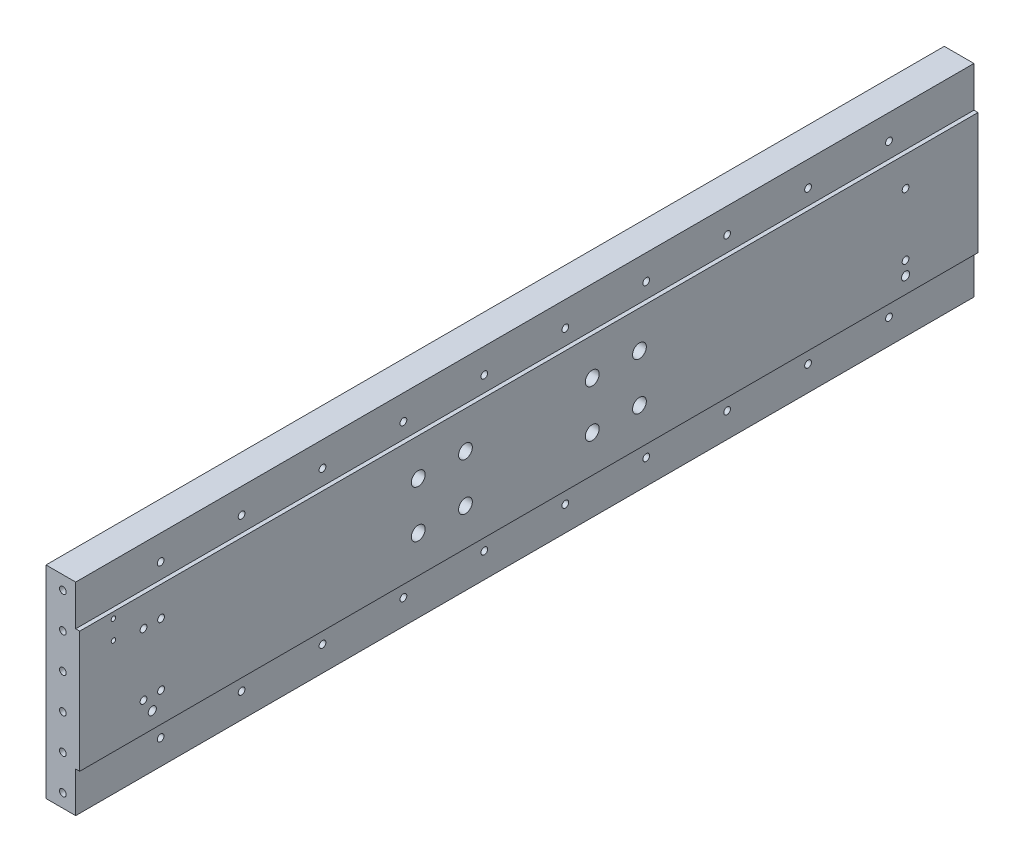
from build123d import *

# Parameters (mm, degrees)
SKIZZE1_W                       = 25
SKIZZE1_H                       = 250
AUFSATZ_LINEAR_AUSTRAGEN1_DEPTH = 700
SKIZZE2_W                       = 22.198987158
SKIZZE2_H                       = 60.887547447
SKIZZE2_W_2                     = 19.880786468
SKIZZE2_H_2                     = 59.665397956
SCHNITT_LINEAR_AUSTRAGEN1_DEPTH = 700
SKIZZE3_W                       = 93.157217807
SKIZZE3_H                       = 100
SCHNITT_LINEAR_AUSTRAGEN2_DEPTH = 700
SKIZZE4_W                       = 3
SKIZZE4_H                       = 30
SCHNITT_LINEAR_AUSTRAGEN3_DEPTH = 700
SKIZZE5_W                       = 80
SKIZZE5_H                       = 241.807077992
SCHNITT_LINEAR_AUSTRAGEN4_DEPTH = 30
AUFSATZ_LINEAR_AUSTRAGEN2_DEPTH = 80
SKIZZE7_W                       = 4
SKIZZE7_H                       = 191.318116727
SCHNITT_LINEAR_AUSTRAGEN5_DEPTH = 100
SKIZZE8_W                       = 30
SKIZZE8_H                       = 183.217358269
SCHNITT_LINEAR_AUSTRAGEN6_DEPTH = 100
M6_GEWINDEBOHRUNG1_D            = 5
M6_GEWINDEBOHRUNG1_DEPTH        = 19
M6_GEWINDEBOHRUNG1_TIP          = 1.502151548
M6_GEWINDEBOHRUNG2_D            = 5
M6_GEWINDEBOHRUNG2_DEPTH        = 20
M6_GEWINDEBOHRUNG2_TIP          = 1.502151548
SKIZZE15_R                      = 3
SCHNITT_LINEAR_AUSTRAGEN7_DEPTH = 15
M6_GEWINDEBOHRUNG3_D            = 5
M6_GEWINDEBOHRUNG3_DEPTH        = 25
M6_GEWINDEBOHRUNG3_TIP          = 1.502151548
M6_GEWINDEBOHRUNG4_D            = 5
M6_GEWINDEBOHRUNG4_DEPTH        = 25
M6_GEWINDEBOHRUNG4_TIP          = 1.502151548
M12_GEWINDEBOHRUNG1_D           = 10.2
SKIZZE32_R                      = 12
SCHNITT_LINEAR_AUSTRAGEN8_DEPTH = 1
FASE2_SIZE                      = 6.5
FASE3_SIZE                      = 6.5
FASE4_SIZE                      = 6.5
FASE5_SIZE                      = 6.5
FASE6_SIZE                      = 6.5
M4_GEWINDEBOHRUNG1_D            = 3.3
M4_GEWINDEBOHRUNG1_DEPTH        = 8
M4_GEWINDEBOHRUNG1_TIP          = 0.991420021


with BuildPart() as part:
    # Skizze1 → Aufsatz-Linear austragen1 (new body)
    with BuildSketch(Plane.XY):
        with Locations((12.5, 125)):
            Rectangle(SKIZZE1_W, SKIZZE1_H)
    extrude(amount=AUFSATZ_LINEAR_AUSTRAGEN1_DEPTH)

    # Skizze2 → Schnitt-Linear austragen1 (cut)
    with BuildSketch(Plane.XY.offset(700)):
        with Locations((33.099493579, 245.443773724)):
            Rectangle(SKIZZE2_W, SKIZZE2_H)
        with Locations((31.940393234, 0.167301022)):
            Rectangle(SKIZZE2_W_2, SKIZZE2_H_2)
    extrude(amount=-SCHNITT_LINEAR_AUSTRAGEN1_DEPTH, mode=Mode.SUBTRACT)

    # Skizze3 → Schnitt-Linear austragen2 (cut)
    with BuildSketch(Plane.XY.offset(700)):
        with Locations((46.578608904, 200)):
            Rectangle(SKIZZE3_W, SKIZZE3_H)
    extrude(amount=-SCHNITT_LINEAR_AUSTRAGEN2_DEPTH, mode=Mode.SUBTRACT)

    # Skizze4 → Schnitt-Linear austragen3 (cut)
    with BuildSketch(Plane.XY.offset(700)):
        with Locations((23.5, 135)):
            Rectangle(SKIZZE4_W, SKIZZE4_H)
    extrude(amount=-SCHNITT_LINEAR_AUSTRAGEN3_DEPTH, mode=Mode.SUBTRACT)

    # Skizze5 → Schnitt-Linear austragen4 (cut)
    with BuildSketch(Plane(origin=(25, 0, 0), x_dir=(0, 0, -1), z_dir=(1, 0, 0))):
        with Locations((-660, 82.595664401)):
            Rectangle(SKIZZE5_W, SKIZZE5_H)
    extrude(amount=-SCHNITT_LINEAR_AUSTRAGEN4_DEPTH, mode=Mode.SUBTRACT)

    # Skizze6 → Aufsatz-Linear austragen2 (add)
    with BuildSketch(Plane.XY.offset(620)):
        Polygon((25, 30), (25, 120), (22, 120), (22, 150), (0, 150), (0, 0), (22, 0), (22, 30), align=None)
    extrude(amount=AUFSATZ_LINEAR_AUSTRAGEN2_DEPTH)

    # Skizze7 → Schnitt-Linear austragen5 (cut)
    with BuildSketch(Plane(origin=(25, 0, 0), x_dir=(0, 0, -1), z_dir=(1, 0, 0))):
        with Locations((-2, 95.659058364)):
            Rectangle(SKIZZE7_W, SKIZZE7_H)
    extrude(amount=-SCHNITT_LINEAR_AUSTRAGEN5_DEPTH, mode=Mode.SUBTRACT)

    # Skizze8 → Schnitt-Linear austragen6 (cut)
    with BuildSketch(Plane(origin=(25, 0, 0), x_dir=(0, 0, -1), z_dir=(1, 0, 0))):
        with Locations((-19, 91.608679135)):
            Rectangle(SKIZZE8_W, SKIZZE8_H)
    extrude(amount=-SCHNITT_LINEAR_AUSTRAGEN6_DEPTH, mode=Mode.SUBTRACT)

    # M6 Gewindebohrung1
    with Locations(Plane(origin=(22, 0, 0), x_dir=(0, 0, -1), z_dir=(1, 0, 0))):
        with Locations((-637, 131.5), (-577, 131.5), (-517, 131.5), (-457, 131.5), (-397, 131.5), (-337, 131.5), (-277, 131.5), (-217, 131.5), (-157, 131.5), (-97, 131.5), (-637, 18.5), (-577, 18.5), (-517, 18.5), (-457, 18.5), (-397, 18.5), (-337, 18.5), (-277, 18.5), (-217, 18.5), (-157, 18.5), (-97, 18.5)):
            Hole(M6_GEWINDEBOHRUNG1_D / 2, depth=M6_GEWINDEBOHRUNG1_DEPTH)
            with Locations((0, 0, -(M6_GEWINDEBOHRUNG1_DEPTH + M6_GEWINDEBOHRUNG1_TIP / 2))):  # 118° drill point
                Cone(0, M6_GEWINDEBOHRUNG1_D / 2, M6_GEWINDEBOHRUNG1_TIP, mode=Mode.SUBTRACT)

    # M6 Gewindebohrung2
    with Locations(Plane(origin=(25, 0, 0), x_dir=(0, 0, -1), z_dir=(1, 0, 0))):
        with Locations((-652.7, 98), (-639.7, 98), (-652.7, 52), (-639.7, 52), (-87.7, 98), (-87.7, 52)):
            Hole(M6_GEWINDEBOHRUNG2_D / 2, depth=M6_GEWINDEBOHRUNG2_DEPTH)
            with Locations((0, 0, -(M6_GEWINDEBOHRUNG2_DEPTH + M6_GEWINDEBOHRUNG2_TIP / 2))):  # 118° drill point
                Cone(0, M6_GEWINDEBOHRUNG2_D / 2, M6_GEWINDEBOHRUNG2_TIP, mode=Mode.SUBTRACT)

    # Skizze15 → Schnitt-Linear austragen7 (cut)
    with BuildSketch(Plane(origin=(25, 0, 0), x_dir=(0, 0, -1), z_dir=(1, 0, 0))):
        with Locations((-646.2, 42)):
            Circle(SKIZZE15_R)
        with Locations((-87.7, 42)):
            Circle(SKIZZE15_R)
    extrude(amount=-SCHNITT_LINEAR_AUSTRAGEN7_DEPTH, mode=Mode.SUBTRACT)

    # M6 Gewindebohrung3
    with Locations(Plane.XY.offset(700)):
        with Locations((12.5, 140), (12.5, 114), (12.5, 88), (12.5, 62), (12.5, 36), (12.5, 10)):
            Hole(M6_GEWINDEBOHRUNG3_D / 2, depth=M6_GEWINDEBOHRUNG3_DEPTH)
            with Locations((0, 0, -(M6_GEWINDEBOHRUNG3_DEPTH + M6_GEWINDEBOHRUNG3_TIP / 2))):  # 118° drill point
                Cone(0, M6_GEWINDEBOHRUNG3_D / 2, M6_GEWINDEBOHRUNG3_TIP, mode=Mode.SUBTRACT)

    # M6 Gewindebohrung4
    with Locations(Plane(origin=(0, 0, 34), x_dir=(-1, 0, 0), z_dir=(0, 0, -1))):
        with Locations((-12.5, 140), (-12.5, 114), (-12.5, 88), (-12.5, 62), (-12.5, 36), (-12.5, 10)):
            Hole(M6_GEWINDEBOHRUNG4_D / 2, depth=M6_GEWINDEBOHRUNG4_DEPTH)
            with Locations((0, 0, -(M6_GEWINDEBOHRUNG4_DEPTH + M6_GEWINDEBOHRUNG4_TIP / 2))):  # 118° drill point
                Cone(0, M6_GEWINDEBOHRUNG4_D / 2, M6_GEWINDEBOHRUNG4_TIP, mode=Mode.SUBTRACT)

    # M12 Gewindebohrung1 (through all)
    with Locations(Plane(origin=(25, 0, 0), x_dir=(0, 0, -1), z_dir=(1, 0, 0))):
        with Locations((-449, 92.5), (-449, 57.5), (-414, 92.5), (-414, 57.5), (-320, 92.5), (-320, 57.5), (-285, 57.5), (-285, 92.5)):
            Hole(M12_GEWINDEBOHRUNG1_D / 2)

    # Skizze32 → Schnitt-Linear austragen8 (cut)
    with BuildSketch(Plane.ZY):
        with Locations((285, 92.5)):
            Circle(SKIZZE32_R)
        with Locations((320, 92.5)):
            Circle(SKIZZE32_R)
        with Locations((320, 57.5)):
            Circle(SKIZZE32_R)
        with Locations((285, 57.5)):
            Circle(SKIZZE32_R)
        with Locations((414, 57.5)):
            Circle(SKIZZE32_R)
        with Locations((449, 57.5)):
            Circle(SKIZZE32_R)
        with Locations((449, 92.5)):
            Circle(SKIZZE32_R)
        with Locations((414, 92.5)):
            Circle(SKIZZE32_R)
    extrude(amount=-SCHNITT_LINEAR_AUSTRAGEN8_DEPTH, mode=Mode.SUBTRACT)

    # Fase2
    fase2_edges = [part.edges().sort_by_distance(p)[0] for p in [
        (1, 92.5, 279.9),
    ]]
    chamfer(fase2_edges, length=FASE2_SIZE)

    # Fase3
    fase3_edges = [part.edges().sort_by_distance(p)[0] for p in [
        (1, 92.5, 314.9),
    ]]
    chamfer(fase3_edges, length=FASE3_SIZE)

    # Fase4
    fase4_edges = [part.edges().sort_by_distance(p)[0] for p in [
        (1, 57.5, 314.9),
    ]]
    chamfer(fase4_edges, length=FASE4_SIZE)

    # Fase5
    fase5_edges = [part.edges().sort_by_distance(p)[0] for p in [
        (1, 57.5, 279.9),
    ]]
    chamfer(fase5_edges, length=FASE5_SIZE)

    # Fase6
    fase6_edges = [part.edges().sort_by_distance(p)[0] for p in [
        (1, 57.5, 408.9),
        (1, 57.5, 443.9),
        (1, 92.5, 443.9),
        (1, 92.5, 408.9),
    ]]
    chamfer(fase6_edges, length=FASE6_SIZE)

    # M4 Gewindebohrung1
    with Locations(Plane(origin=(25, 0, 0), x_dir=(0, 0, -1), z_dir=(1, 0, 0))):
        with Locations((-675, 115.5), (-675, 101.5)):
            Hole(M4_GEWINDEBOHRUNG1_D / 2, depth=M4_GEWINDEBOHRUNG1_DEPTH)
            with Locations((0, 0, -(M4_GEWINDEBOHRUNG1_DEPTH + M4_GEWINDEBOHRUNG1_TIP / 2))):  # 118° drill point
                Cone(0, M4_GEWINDEBOHRUNG1_D / 2, M4_GEWINDEBOHRUNG1_TIP, mode=Mode.SUBTRACT)


solid = part.part
